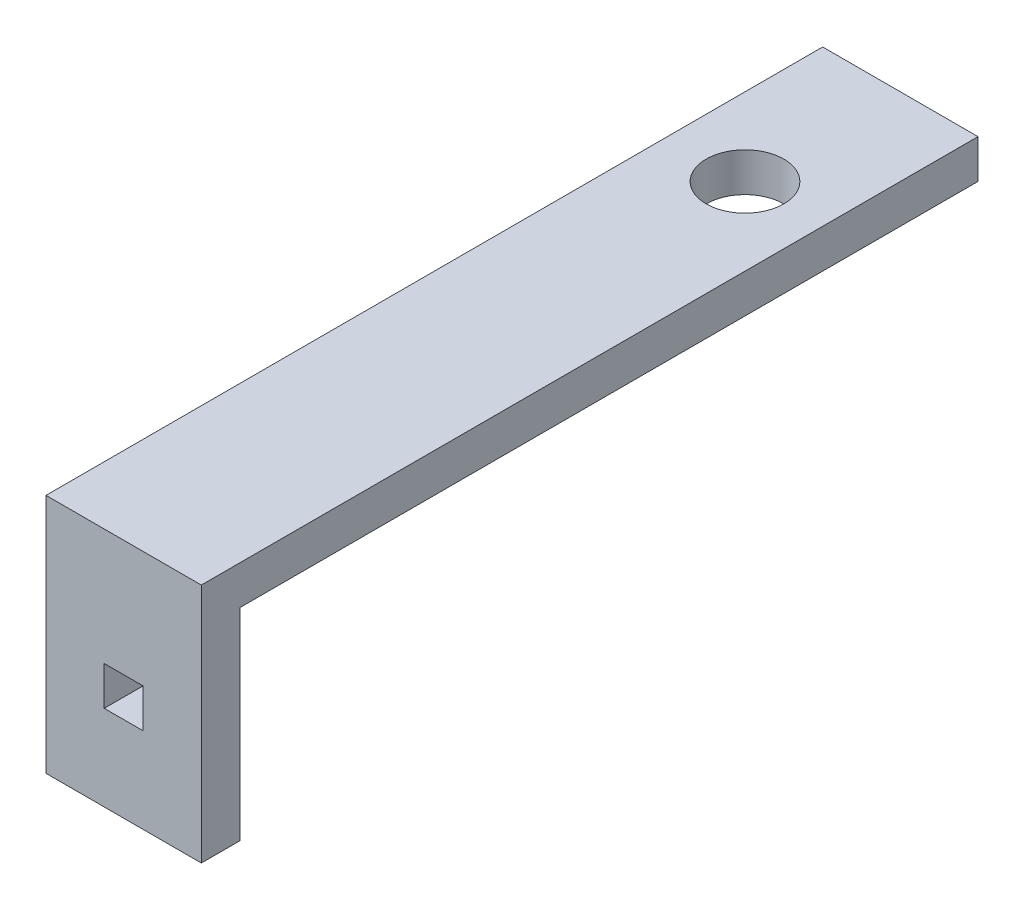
from build123d import *

# Parameters (mm, degrees)
BOSS_EXTRUDE1_DEPTH = 20
CUT_EXTRUDE1_REACH  = 85.998
SKETCH3_R           = 5
CUT_EXTRUDE2_REACH  = 108.721
SKETCH4_W           = 5
SKETCH4_H           = 5


with BuildPart() as part:
    # Sketch2 → Boss-Extrude1 (new body)
    with BuildSketch(Plane(origin=(12.809728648, 0, 0), x_dir=(0, 0, -1), z_dir=(1, 0, 0))):
        Polygon((-24.160822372, 8.308152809), (70.839177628, 8.308152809), (70.839177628, 13.308152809), (-29.160822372, 13.308152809), (-29.160822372, -17.691061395), (-24.160822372, -17.691061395), align=None)
    extrude(amount=BOSS_EXTRUDE1_DEPTH)

    # Sketch3 → Cut-Extrude1 (cut, up to next)
    with BuildSketch(Plane(origin=(0, 13.308152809, 0), x_dir=(1, 0, 0), z_dir=(0, 1, 0)), mode=Mode.PRIVATE) as cut_extrude1_sk1:
        with Locations(Location((22.809728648, 50.839177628, 0), (0, 0, 270))):
            Circle(SKETCH3_R)
    cut_extrude1_tool1 = extrude(cut_extrude1_sk1.sketch, amount=-CUT_EXTRUDE1_REACH, mode=Mode.PRIVATE) & part.part
    add(cut_extrude1_tool1.solids().sort_by_distance((22.809729, 13.308153, -50.839178))[0], mode=Mode.SUBTRACT)

    # Sketch4 → Cut-Extrude2 (cut, up to next)
    with BuildSketch(Plane.XY.offset(29.160822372), mode=Mode.PRIVATE) as cut_extrude2_sk1:
        with Locations((22.809728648, -4.191061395)):
            Rectangle(SKETCH4_W, SKETCH4_H)
    cut_extrude2_tool1 = extrude(cut_extrude2_sk1.sketch, amount=-CUT_EXTRUDE2_REACH, mode=Mode.PRIVATE) & part.part
    add(cut_extrude2_tool1.solids().sort_by_distance((22.809729, -4.191061, 29.160822))[0], mode=Mode.SUBTRACT)


solid = part.part
